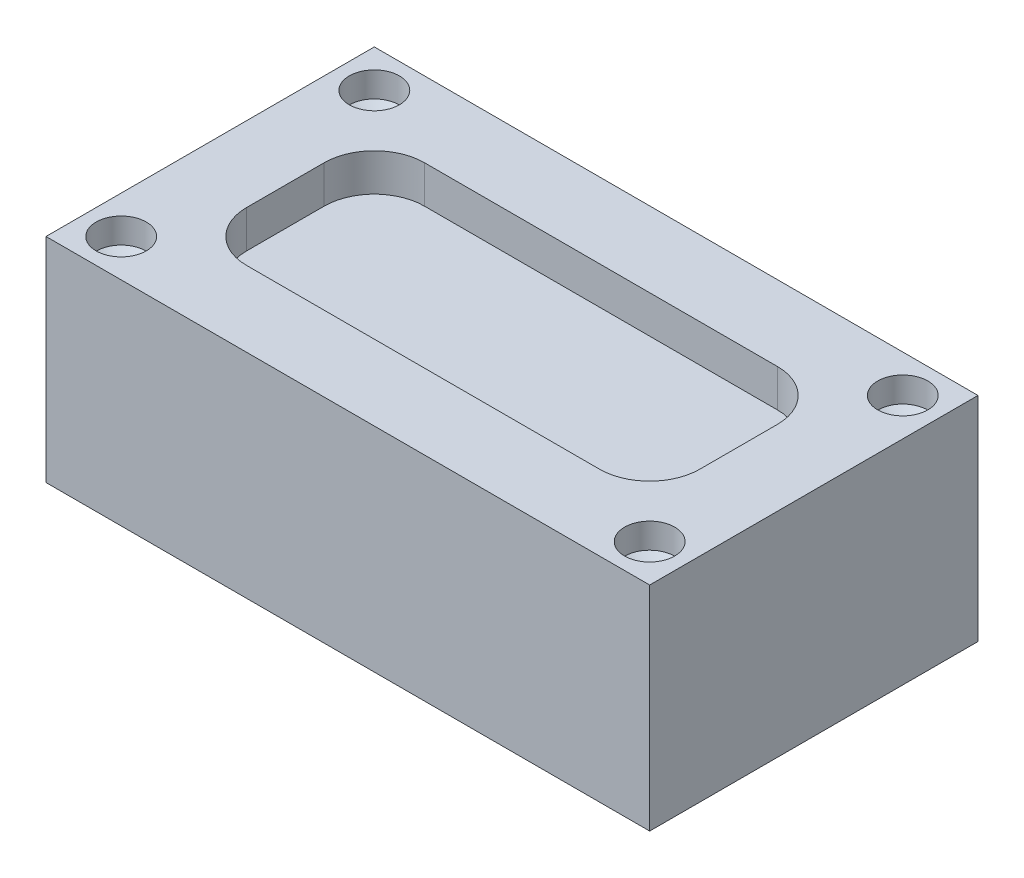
from build123d import *

# Parameters (mm, degrees)
SKETCH3_W                  = 240.765342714
SKETCH3_H                  = 130.947670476
BOSS_EXTRUDE2_DEPTH        = 85
SKETCH4_W                  = 180.765342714
SKETCH4_H                  = 70.947670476
CUT_EXTRUDE1_DEPTH         = 15
F_20_0MM_DOWEL_HOLE1_D     = 20
F_20_0MM_DOWEL_HOLE1_DEPTH = 10.05
F_20_0MM_DOWEL_HOLE1_TIP   = 6.00860619
FILLET1_R                  = 20


with BuildPart() as part:
    # Sketch3 → Boss-Extrude2 (new body)
    with BuildSketch(Plane(origin=(0, 0, 0), x_dir=(1, 0, 0), z_dir=(0, 1, 0))):
        Rectangle(SKETCH3_W, SKETCH3_H)
    extrude(amount=BOSS_EXTRUDE2_DEPTH)

    # Sketch4 → Cut-Extrude1 (cut)
    with BuildSketch(Plane(origin=(0, 85, 0), x_dir=(1, 0, 0), z_dir=(0, 1, 0))):
        Rectangle(SKETCH4_W, SKETCH4_H)
    extrude(amount=-CUT_EXTRUDE1_DEPTH, mode=Mode.SUBTRACT)

    # 20.0mm Dowel Hole1
    with Locations(Plane(origin=(-105.382671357, 85, -50.473835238), x_dir=(0, 0, 1), z_dir=(0, 1, 0))):
        with Locations((0, 0), (100.947670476, 0), (0, 210.765342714), (100.947670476, 210.765342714)):
            Hole(F_20_0MM_DOWEL_HOLE1_D / 2, depth=F_20_0MM_DOWEL_HOLE1_DEPTH)
            with Locations((0, 0, -(F_20_0MM_DOWEL_HOLE1_DEPTH + F_20_0MM_DOWEL_HOLE1_TIP / 2))):  # 118° drill point
                Cone(0, F_20_0MM_DOWEL_HOLE1_D / 2, F_20_0MM_DOWEL_HOLE1_TIP, mode=Mode.SUBTRACT)

    # Fillet1
    fillet1_edges = [part.edges().sort_by_distance(p)[0] for p in [
        (90.382671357, 77.5, 35.473835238),
        (-90.382671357, 77.5, 35.473835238),
        (-90.382671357, 77.5, -35.473835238),
        (90.382671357, 77.5, -35.473835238),
    ]]
    fillet(fillet1_edges, radius=FILLET1_R)


solid = part.part
